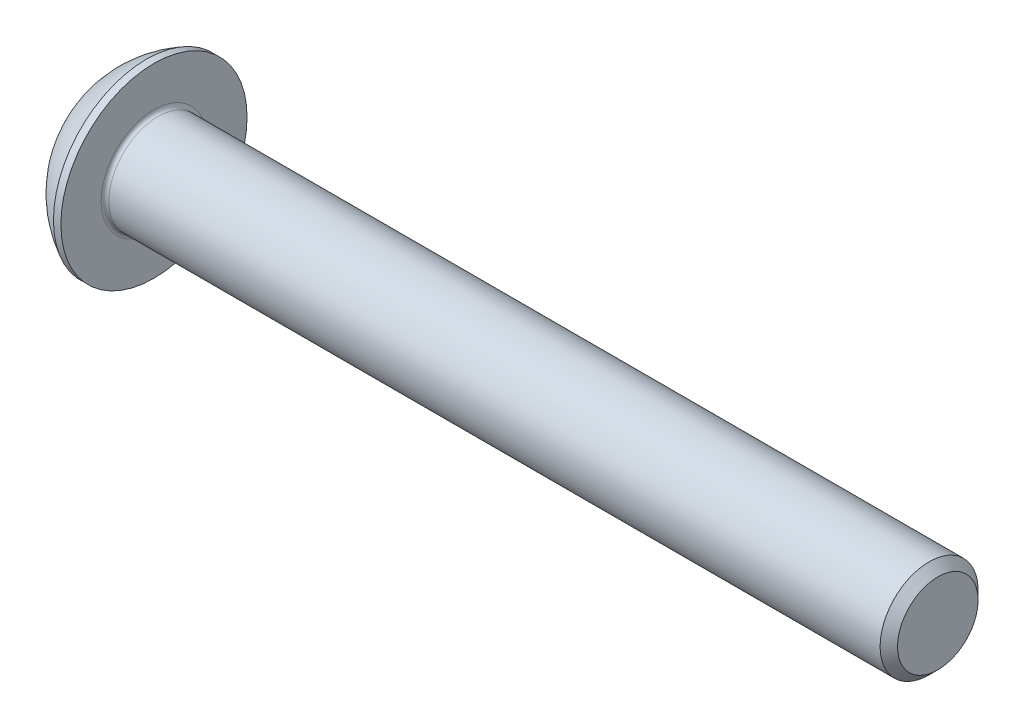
from build123d import *

# Parameters (mm, degrees)
FILLET1_R   = 0.2
HEX_2_DEPTH = 1.56


with BuildPart() as part:
    # BodySke → BaseBody (revolve)
    with BuildSketch(Plane.XY, mode=Mode.PRIVATE) as basebody_sk:
        with BuildLine():
            Line((42.75, 0), (42.75, 2.055))
            Line((42.75, 2.055), (42.305, 2.5))
            Line((42.305, 2.5), (2.75, 2.5))
            Line((2.75, 2.5), (2.75, 4.75))
            Line((2.75, 4.75), (2.37, 4.75))
            ThreePointArc((2.37, 4.75), (0.992680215, 3.754414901), (0, 2.375))
            Line((0, 2.375), (0, 0))
            Line((0, 0), (42.75, 0))
        make_face()
    revolve(basebody_sk.sketch.rotate(Axis((0, 0, 0), (1, 0, 0)), 90), axis=Axis((0, 0, 0), (1, 0, 0)))

    # Fillet1
    fillet1_edges = [part.edges().sort_by_distance(p)[0] for p in [
        (2.75, 0, -2.5),
    ]]
    fillet(fillet1_edges, radius=FILLET1_R)

    # Sketch2 → PreBroach (revolve, cut)
    with BuildSketch(Plane.XY, mode=Mode.PRIVATE) as prebroach_sk:
        Polygon((0, 1.5), (1.56, 1.5), (2.426025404, 0), (0, 0), align=None)
    revolve(prebroach_sk.sketch.rotate(Axis((0, 0, 0), (1, 0, 0)), 90), axis=Axis((0, 0, 0), (1, 0, 0)), mode=Mode.SUBTRACT)

    # Sketch3 → Hex 2 (cut)
    with BuildSketch(Plane(origin=(0, 0, 0), x_dir=(0, 0, -1), z_dir=(1, 0, 0))):
        Polygon((-1.5, -0.866025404), (-1.5, 0.866025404), (0, 1.732050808), (1.5, 0.866025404), (1.5, -0.866025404), (0, -1.732050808), align=None)
    extrude(amount=HEX_2_DEPTH, mode=Mode.SUBTRACT)


solid = part.part
